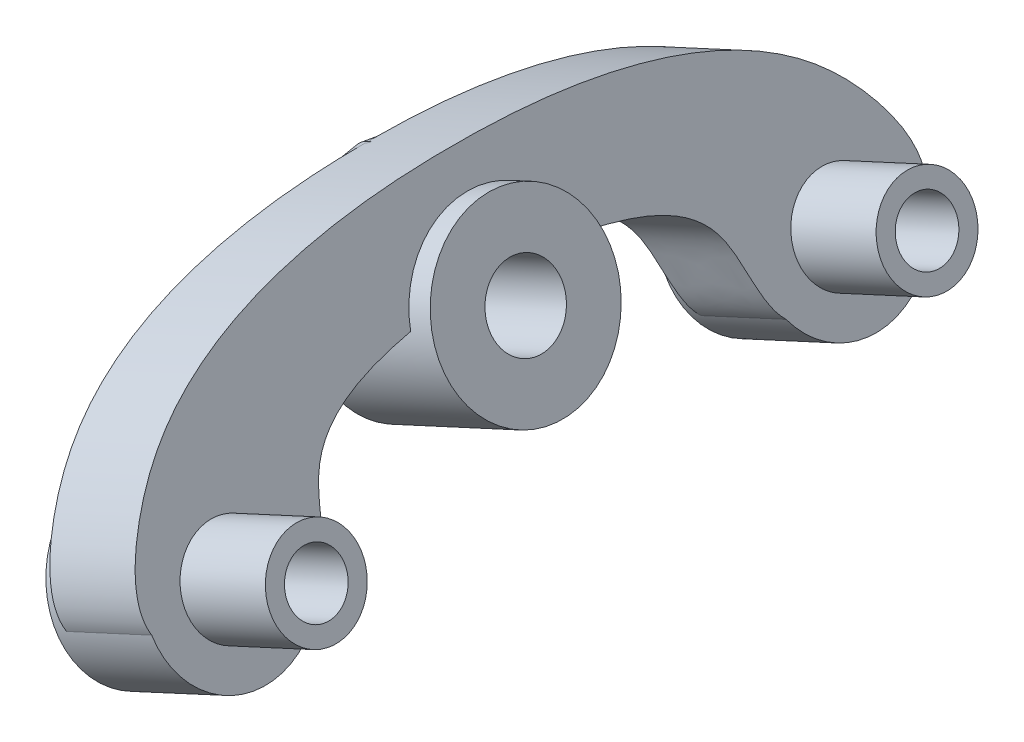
from build123d import *

# Parameters (mm, degrees)
ARCO_DEPTH                  = 4
NERVIO_PROFILE_R            = 2.5
BUJE_CENTRAL_PROFILE_R      = 7.5
BUJE_PIVOTE_IZQ_PROFILE_R   = 7
PIVOTE_IZQ_PROFILE_R        = 4
TOPE_MUELLE_IZQ_PROFILE_R   = 1.25
BUJE_PIVOTE_DCHO_PROFILE_R  = 7
PIVOTE_DCHO_PROFILE_R       = 4
TOPE_MUELLE_DCHO_PROFILE_R  = 1.25
TALADRO_CENTRAL_PROFILE_R   = 3.2
ROSCA_PIVOTE_IZQ_PROFILE_R  = 2.5
ROSCA_PIVOTE_DCHO_PROFILE_R = 2.5


with BuildPart() as part:
    # Sk_Arco → Arco (new, symmetric)
    with BuildSketch(Plane(origin=(501.248292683, 231.345365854, 0), x_dir=(0, 0, 1), z_dir=(-0.9079593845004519, -0.41905817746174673, 0))):
        with BuildLine():
            add(Edge.make_bspline(
                [(-33, 167.213202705), (-33.809816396, 169.344461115), (-30.928090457, 175.483754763), (-23.700876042, 181.126046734), (-12.514498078, 184.250371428), (0, 184.958692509), (12.514498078, 184.250371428), (23.700876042, 181.126046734), (30.928090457, 175.483754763), (36.139987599, 164.380212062), (18.204481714, 160.219142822), (18.333257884, 172.472368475), (9.189019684, 175.889853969), (0, 176.39261915), (-9.189019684, 175.889853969), (-18.333257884, 172.472368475), (-18.204481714, 160.219142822), (-31.51591549, 163.307419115), (-33, 167.213202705)],
                knots=[0, 0, 0, 0, 0.045414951, 0.102928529, 0.174938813, 0.256275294, 0.337611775, 0.409622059, 0.467135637, 0.512550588, 0.595778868, 0.643287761, 0.693581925, 0.756275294, 0.818968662, 0.869262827, 0.91677172, 1, 1, 1, 1], degree=3))
        make_face()
    extrude(amount=ARCO_DEPTH, both=True)

    # Nervio: sweep along a curve in space
    with BuildLine() as nervio_path:
        Line((422.096638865, 393.295401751, -14), (421.25852251, 395.11132052, 0))
        Line((421.25852251, 395.11132052, 0), (422.096638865, 393.295401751, 14))
    # Nervio profile (on start of the path) → Nervio (sweep)
    with BuildSketch(Plane(origin=(422.096638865, 393.295401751, -14), x_dir=(0, 0.9916925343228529, -0.12863093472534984), z_dir=(-0.05926377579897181, 0.12840484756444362, 0.9899494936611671))):
        Circle(NERVIO_PROFILE_R)
    sweep(path=nervio_path.line, transition=Transition.RIGHT)

    # Buje_central: sweep along a curve in space
    with BuildLine() as buje_central_path:
        Line((422.795069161, 387.009529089, 0), (433.690581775, 392.038227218, 0))
    # Buje_central profile (on start of the path) → Buje_central (sweep)
    with BuildSketch(Plane(origin=(422.795069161, 387.009529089, 0), x_dir=(-0.4190581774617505, 0.90795938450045, 0), z_dir=(0.90795938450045, 0.4190581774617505, 0))):
        Circle(BUJE_CENTRAL_PROFILE_R)
    sweep(path=buje_central_path.line)

    # Buje_pivote_izq: sweep along a curve in space
    with BuildLine() as buje_pivote_izq_path:
        Line((426.426906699, 381.526851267, -26), (434.598541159, 385.298374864, -26))
    # Buje_pivote_izq profile (on start of the path) → Buje_pivote_izq (sweep)
    with BuildSketch(Plane(origin=(426.426906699, 381.526851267, -26), x_dir=(-0.41905817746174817, 0.9079593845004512, 0), z_dir=(0.9079593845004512, 0.41905817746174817, 0))):
        Circle(BUJE_PIVOTE_IZQ_PROFILE_R)
    sweep(path=buje_pivote_izq_path.line)

    # Pivote_izq: sweep along a curve in space
    with BuildLine() as pivote_izq_path:
        Line((434.598541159, 385.298374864, -26), (441.862216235, 388.650840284, -26))
    # Pivote_izq profile (on start of the path) → Pivote_izq (sweep)
    with BuildSketch(Plane(origin=(434.598541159, 385.298374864, -26), x_dir=(-0.4190581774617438, 0.9079593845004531, 0), z_dir=(0.9079593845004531, 0.4190581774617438, 0))):
        Circle(PIVOTE_IZQ_PROFILE_R)
    sweep(path=pivote_izq_path.line)

    # Tope_muelle_izq: sweep along a curve in space
    with BuildLine() as tope_muelle_izq_path:
        Line((425.169732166, 391.409639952, -16.12), (425.169732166, 391.409639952, -19.12))
        Line((425.169732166, 391.409639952, -19.12), (419.721975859, 388.895290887, -19.12))
    # Tope_muelle_izq profile (on start of the path) → Tope_muelle_izq (sweep)
    with BuildSketch(Plane(origin=(425.169732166, 391.409639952, -16.12), x_dir=(-1, 0, 0), z_dir=(0, 0, -1))):
        Circle(TOPE_MUELLE_IZQ_PROFILE_R)
    sweep(path=tope_muelle_izq_path.line, transition=Transition.RIGHT)

    # Buje_pivote_dcho: sweep along a curve in space
    with BuildLine() as buje_pivote_dcho_path:
        Line((426.426906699, 381.526851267, 26), (434.598541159, 385.298374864, 26))
    # Buje_pivote_dcho profile (on start of the path) → Buje_pivote_dcho (sweep)
    with BuildSketch(Plane(origin=(426.426906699, 381.526851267, 26), x_dir=(-0.41905817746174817, 0.9079593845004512, 0), z_dir=(0.9079593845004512, 0.41905817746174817, 0))):
        Circle(BUJE_PIVOTE_DCHO_PROFILE_R)
    sweep(path=buje_pivote_dcho_path.line)

    # Pivote_dcho: sweep along a curve in space
    with BuildLine() as pivote_dcho_path:
        Line((434.598541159, 385.298374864, 26), (441.862216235, 388.650840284, 26))
    # Pivote_dcho profile (on start of the path) → Pivote_dcho (sweep)
    with BuildSketch(Plane(origin=(434.598541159, 385.298374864, 26), x_dir=(-0.4190581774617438, 0.9079593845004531, 0), z_dir=(0.9079593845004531, 0.4190581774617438, 0))):
        Circle(PIVOTE_DCHO_PROFILE_R)
    sweep(path=pivote_dcho_path.line)

    # Tope_muelle_dcho: sweep along a curve in space
    with BuildLine() as tope_muelle_dcho_path:
        Line((425.169732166, 391.409639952, 16.12), (425.169732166, 391.409639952, 19.12))
        Line((425.169732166, 391.409639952, 19.12), (419.721975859, 388.895290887, 19.12))
    # Tope_muelle_dcho profile (on start of the path) → Tope_muelle_dcho (sweep)
    with BuildSketch(Plane(origin=(425.169732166, 391.409639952, 16.12), x_dir=(1, 0, 0), z_dir=(0, 0, 1))):
        Circle(TOPE_MUELLE_DCHO_PROFILE_R)
    sweep(path=tope_muelle_dcho_path.line, transition=Transition.RIGHT)

    # Taladro_central: sweep along a curve in space
    with BuildLine() as taladro_central_path:
        Line((420.979150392, 386.171412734, 0), (435.506500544, 392.876343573, 0))
    # Taladro_central profile (on start of the path) → Taladro_central (sweep, cut)
    with BuildSketch(Plane(origin=(420.979150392, 386.171412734, 0), x_dir=(-0.4190581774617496, 0.9079593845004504, 0), z_dir=(0.9079593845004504, 0.4190581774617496, 0))):
        Circle(TALADRO_CENTRAL_PROFILE_R)
    sweep(path=taladro_central_path.line, mode=Mode.SUBTRACT)

    # Rosca_pivote_izq: sweep along a curve in space
    with BuildLine() as rosca_pivote_izq_path:
        Line((425.518947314, 381.107793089, -26), (442.77017562, 389.069898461, -26))
    # Rosca_pivote_izq profile (on start of the path) → Rosca_pivote_izq (sweep, cut)
    with BuildSketch(Plane(origin=(425.518947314, 381.107793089, -26), x_dir=(-0.41905817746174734, 0.9079593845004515, 0), z_dir=(0.9079593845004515, 0.41905817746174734, 0))):
        Circle(ROSCA_PIVOTE_IZQ_PROFILE_R)
    sweep(path=rosca_pivote_izq_path.line, mode=Mode.SUBTRACT)

    # Rosca_pivote_dcho: sweep along a curve in space
    with BuildLine() as rosca_pivote_dcho_path:
        Line((425.518947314, 381.107793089, 26), (442.77017562, 389.069898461, 26))
    # Rosca_pivote_dcho profile (on start of the path) → Rosca_pivote_dcho (sweep, cut)
    with BuildSketch(Plane(origin=(425.518947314, 381.107793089, 26), x_dir=(-0.41905817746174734, 0.9079593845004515, 0), z_dir=(0.9079593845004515, 0.41905817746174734, 0))):
        Circle(ROSCA_PIVOTE_DCHO_PROFILE_R)
    sweep(path=rosca_pivote_dcho_path.line, mode=Mode.SUBTRACT)


solid = part.part
